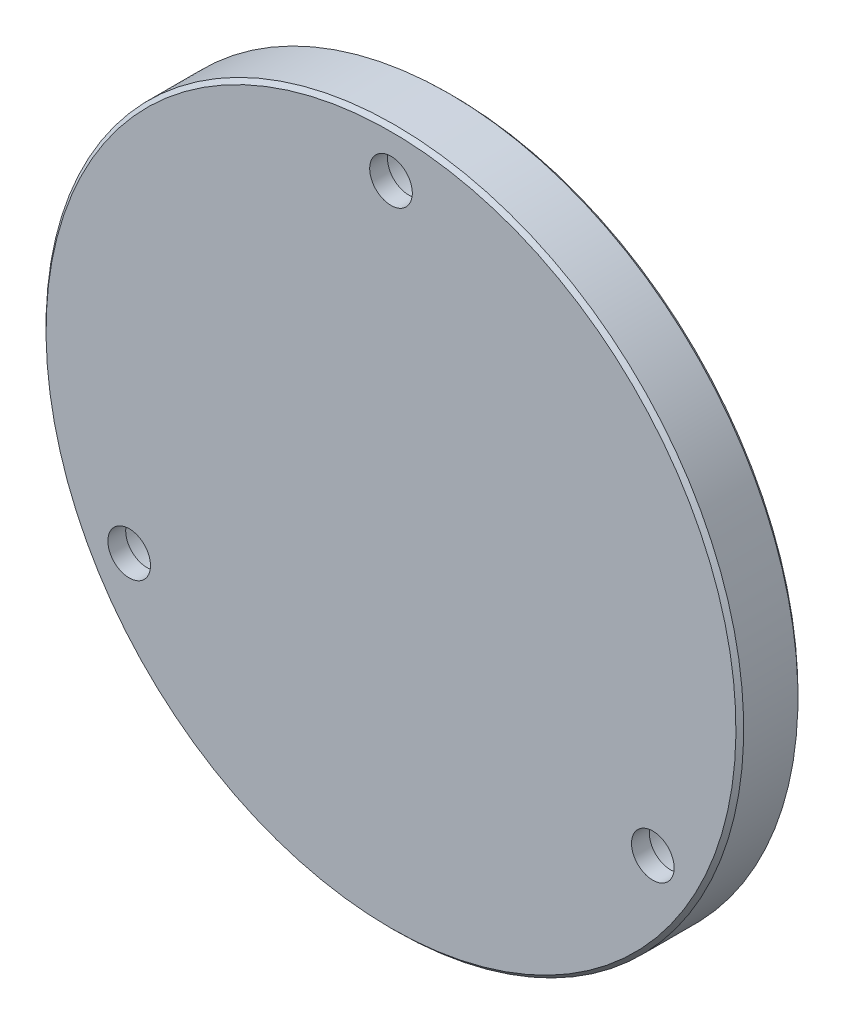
from build123d import *

# Parameters (mm, degrees)
CBORE_FOR_M5_HEX_SOCKET_HEAD_CAP_SCREW1_D           = 5.5
CBORE_FOR_M5_HEX_SOCKET_HEAD_CAP_SCREW1_CBORE_D     = 10
CBORE_FOR_M5_HEX_SOCKET_HEAD_CAP_SCREW1_CBORE_DEPTH = 5.7


with BuildPart() as part:
    # Sketch1 → Revolve1 (revolve)
    with BuildSketch(Plane(origin=(0, -18, -1.35), x_dir=(0, 0, -1), z_dir=(1, 0, 0)), mode=Mode.PRIVATE) as revolve1_sk:
        Polygon((-5.35, 18), (2.65, 18), (2.65, 62.5), (2.15, 63), (-4.85, 63), (-5.35, 62.5), align=None)
    revolve(revolve1_sk.sketch.rotate(Axis((0, 0, -4), (0, 0, -1)), 180), axis=Axis((0, 0, -4), (0, 0, -1)))

    # CBORE for M5 Hex Socket Head Cap Screw1 (through all)
    with Locations(Plane(origin=(0, 0, -4), x_dir=(-1, 0, 0), z_dir=(0, 0, -1))):
        with Locations((0, 39), (33.774990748, -19.5), (-33.774990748, -19.5)):
            CounterBoreHole(CBORE_FOR_M5_HEX_SOCKET_HEAD_CAP_SCREW1_D / 2, CBORE_FOR_M5_HEX_SOCKET_HEAD_CAP_SCREW1_CBORE_D / 2, CBORE_FOR_M5_HEX_SOCKET_HEAD_CAP_SCREW1_CBORE_DEPTH)


solid = part.part
